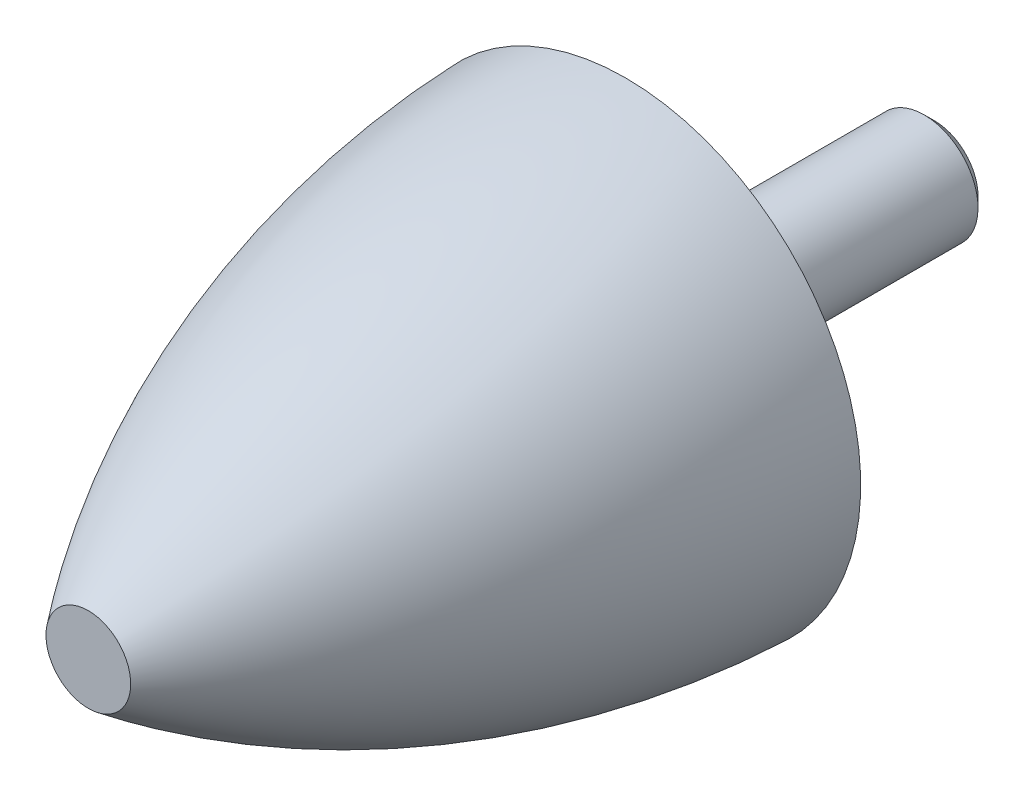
ISO-10303-21;
HEADER;
FILE_DESCRIPTION(('STEP AP214'),'2;1');
FILE_NAME('part.step','',(''),(''),'','','');
FILE_SCHEMA(('AUTOMOTIVE_DESIGN { 1 0 10303 214 1 1 1 1 }'));
ENDSEC;
DATA;
#1=APPLICATION_CONTEXT('core data for automotive mechanical design processes');
#2=APPLICATION_PROTOCOL_DEFINITION('international standard','automotive_design',2000,#1);
#3=PRODUCT_CONTEXT('',#1,'mechanical');
#4=PRODUCT('Part','Part','',(#3));
#5=PRODUCT_RELATED_PRODUCT_CATEGORY('part','',(#4));
#6=PRODUCT_DEFINITION_FORMATION('','',#4);
#7=PRODUCT_DEFINITION_CONTEXT('part definition',#1,'design');
#8=PRODUCT_DEFINITION('design','',#6,#7);
#9=PRODUCT_DEFINITION_SHAPE('','',#8);
#10=(LENGTH_UNIT() NAMED_UNIT(*) SI_UNIT(.MILLI.,.METRE.));
#11=(NAMED_UNIT(*) PLANE_ANGLE_UNIT() SI_UNIT($,.RADIAN.));
#12=(NAMED_UNIT(*) SI_UNIT($,.STERADIAN.) SOLID_ANGLE_UNIT());
#13=UNCERTAINTY_MEASURE_WITH_UNIT(LENGTH_MEASURE(1.E-05),#10,'distance_accuracy_value','');
#14=(GEOMETRIC_REPRESENTATION_CONTEXT(3) GLOBAL_UNCERTAINTY_ASSIGNED_CONTEXT((#13)) GLOBAL_UNIT_ASSIGNED_CONTEXT((#10,
#11,#12)) REPRESENTATION_CONTEXT('',''));
#15=CARTESIAN_POINT('',(0.,0.,0.));
#16=DIRECTION('',(0.,0.,1.));
#17=DIRECTION('',(1.,0.,0.));
#18=AXIS2_PLACEMENT_3D('',#15,#16,#17);
#19=CARTESIAN_POINT('',(17.5,0.,0.));
#20=DIRECTION('',(0.,0.,1.));
#21=DIRECTION('',(0.,-1.,0.));
#22=AXIS2_PLACEMENT_3D('',#19,#20,#21);
#23=PLANE('',#22);
#24=CARTESIAN_POINT('',(0.,0.,0.));
#25=DIRECTION('',(0.,0.,-1.));
#26=DIRECTION('',(0.,1.,0.));
#27=AXIS2_PLACEMENT_3D('',#24,#25,#26);
#28=CIRCLE('',#27,4.);
#29=CARTESIAN_POINT('',(0.,4.,0.));
#30=VERTEX_POINT('',#29);
#31=EDGE_CURVE('E23',#30,#30,#28,.T.);
#32=ORIENTED_EDGE('',*,*,#31,.F.);
#33=EDGE_LOOP('',(#32));
#34=FACE_BOUND('',#33,.T.);
#35=CARTESIAN_POINT('',(0.,0.,0.));
#36=DIRECTION('',(0.,0.,-1.));
#37=DIRECTION('',(0.,1.,0.));
#38=AXIS2_PLACEMENT_3D('',#35,#36,#37);
#39=CIRCLE('',#38,17.5);
#40=CARTESIAN_POINT('',(0.,17.5,0.));
#41=VERTEX_POINT('',#40);
#42=EDGE_CURVE('E19',#41,#41,#39,.T.);
#43=ORIENTED_EDGE('',*,*,#42,.T.);
#44=EDGE_LOOP('',(#43));
#45=FACE_BOUND('',#44,.T.);
#46=ADVANCED_FACE('F12',(#34,#45),#23,.F.);
#47=CARTESIAN_POINT('',(0.,0.,40.));
#48=DIRECTION('',(0.,0.,-1.));
#49=DIRECTION('',(0.,1.,0.));
#50=AXIS2_PLACEMENT_3D('',#47,#48,#49);
#51=PLANE('',#50);
#52=CARTESIAN_POINT('',(0.,0.,40.));
#53=DIRECTION('',(0.,0.,-1.));
#54=DIRECTION('',(0.,1.,0.));
#55=AXIS2_PLACEMENT_3D('',#52,#53,#54);
#56=CIRCLE('',#55,3.15315315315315);
#57=CARTESIAN_POINT('',(0.,3.15315315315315,40.));
#58=VERTEX_POINT('',#57);
#59=EDGE_CURVE('E8',#58,#58,#56,.T.);
#60=ORIENTED_EDGE('',*,*,#59,.F.);
#61=EDGE_LOOP('',(#60));
#62=FACE_BOUND('',#61,.T.);
#63=ADVANCED_FACE('F14',(#62),#51,.F.);
#64=CARTESIAN_POINT('',(0.,0.,-2.51783516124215));
#65=DIRECTION('',(0.,0.,-1.));
#66=DIRECTION('',(0.,1.,0.));
#67=AXIS2_PLACEMENT_3D('',#64,#65,#66);
#68=DEGENERATE_TOROIDAL_SURFACE('',#67,52.4547032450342,70.,.F.);
#69=ORIENTED_EDGE('',*,*,#59,.T.);
#70=EDGE_LOOP('',(#69));
#71=FACE_BOUND('',#70,.T.);
#72=ORIENTED_EDGE('',*,*,#42,.F.);
#73=EDGE_LOOP('',(#72));
#74=FACE_BOUND('',#73,.T.);
#75=ADVANCED_FACE('F47',(#71,#74),#68,.F.);
#76=CARTESIAN_POINT('',(0.,0.,-23.));
#77=DIRECTION('',(0.,0.,-1.));
#78=DIRECTION('',(0.,1.,0.));
#79=AXIS2_PLACEMENT_3D('',#76,#77,#78);
#80=CYLINDRICAL_SURFACE('',#79,4.);
#81=CARTESIAN_POINT('',(0.,0.,-22.233));
#82=DIRECTION('',(0.,0.,-1.));
#83=DIRECTION('',(0.,1.,0.));
#84=AXIS2_PLACEMENT_3D('',#81,#82,#83);
#85=CIRCLE('',#84,4.);
#86=CARTESIAN_POINT('',(0.,4.,-22.233));
#87=VERTEX_POINT('',#86);
#88=EDGE_CURVE('E27',#87,#87,#85,.T.);
#89=ORIENTED_EDGE('',*,*,#88,.F.);
#90=EDGE_LOOP('',(#89));
#91=FACE_BOUND('',#90,.T.);
#92=ORIENTED_EDGE('',*,*,#31,.T.);
#93=EDGE_LOOP('',(#92));
#94=FACE_BOUND('',#93,.T.);
#95=ADVANCED_FACE('F41',(#91,#94),#80,.T.);
#96=CARTESIAN_POINT('',(0.,0.,-22.233));
#97=DIRECTION('',(0.,0.,1.));
#98=DIRECTION('',(0.,-1.,0.));
#99=AXIS2_PLACEMENT_3D('',#96,#97,#98);
#100=CONICAL_SURFACE('',#99,4.,0.785398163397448);
#101=CARTESIAN_POINT('',(0.,0.,-23.));
#102=DIRECTION('',(0.,0.,-1.));
#103=DIRECTION('',(0.,1.,0.));
#104=AXIS2_PLACEMENT_3D('',#101,#102,#103);
#105=CIRCLE('',#104,3.233);
#106=CARTESIAN_POINT('',(0.,3.233,-23.));
#107=VERTEX_POINT('',#106);
#108=EDGE_CURVE('E32',#107,#107,#105,.T.);
#109=ORIENTED_EDGE('',*,*,#108,.F.);
#110=EDGE_LOOP('',(#109));
#111=FACE_BOUND('',#110,.T.);
#112=ORIENTED_EDGE('',*,*,#88,.T.);
#113=EDGE_LOOP('',(#112));
#114=FACE_BOUND('',#113,.T.);
#115=ADVANCED_FACE('F38',(#111,#114),#100,.T.);
#116=CARTESIAN_POINT('',(3.233,0.,-23.));
#117=DIRECTION('',(0.,0.,1.));
#118=DIRECTION('',(0.,-1.,0.));
#119=AXIS2_PLACEMENT_3D('',#116,#117,#118);
#120=PLANE('',#119);
#121=ORIENTED_EDGE('',*,*,#108,.T.);
#122=EDGE_LOOP('',(#121));
#123=FACE_BOUND('',#122,.T.);
#124=ADVANCED_FACE('F36',(#123),#120,.F.);
#125=CLOSED_SHELL('',(#46,#63,#75,#95,#115,#124));
#126=MANIFOLD_SOLID_BREP('B1',#125);
#127=ADVANCED_BREP_SHAPE_REPRESENTATION('',(#18,#126),#14);
#128=SHAPE_DEFINITION_REPRESENTATION(#9,#127);
ENDSEC;
END-ISO-10303-21;
